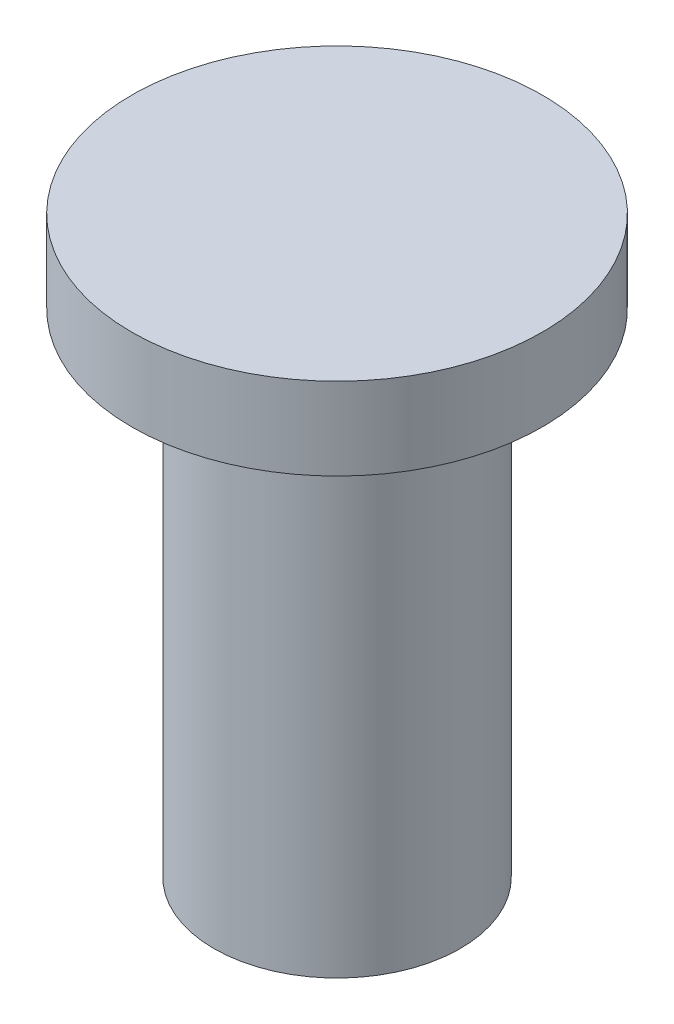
from build123d import *

# Parameters (mm, degrees)
SKETCH1_R           = 7.5
BOSS_EXTRUDE1_DEPTH = 30
SKETCH2_R           = 12.5
BOSS_EXTRUDE2_DEPTH = 5
SCALE1_SCALE        = 0.9


with BuildPart() as part:
    # Sketch1 → Boss-Extrude1 (new body)
    with BuildSketch(Plane(origin=(0, 0, 0), x_dir=(1, 0, 0), z_dir=(0, 1, 0))):
        with Locations(Location((0, 0, 0), (0, 0, 270))):
            Circle(SKETCH1_R)
    extrude(amount=BOSS_EXTRUDE1_DEPTH)

    # Sketch2 → Boss-Extrude2 (add)
    with BuildSketch(Plane(origin=(0, 30, 0), x_dir=(1, 0, 0), z_dir=(0, 1, 0))):
        with Locations(Location((0, 0, 0), (0, 0, 270))):
            Circle(SKETCH2_R)
    extrude(amount=BOSS_EXTRUDE2_DEPTH)


with BuildPart() as part_1:
    # Scale1: scaled about (0, 20.537974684, 0)
    add(part.part.scale(SCALE1_SCALE).moved(Location((0, 2.053797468, 0))))


solid = part_1.part
